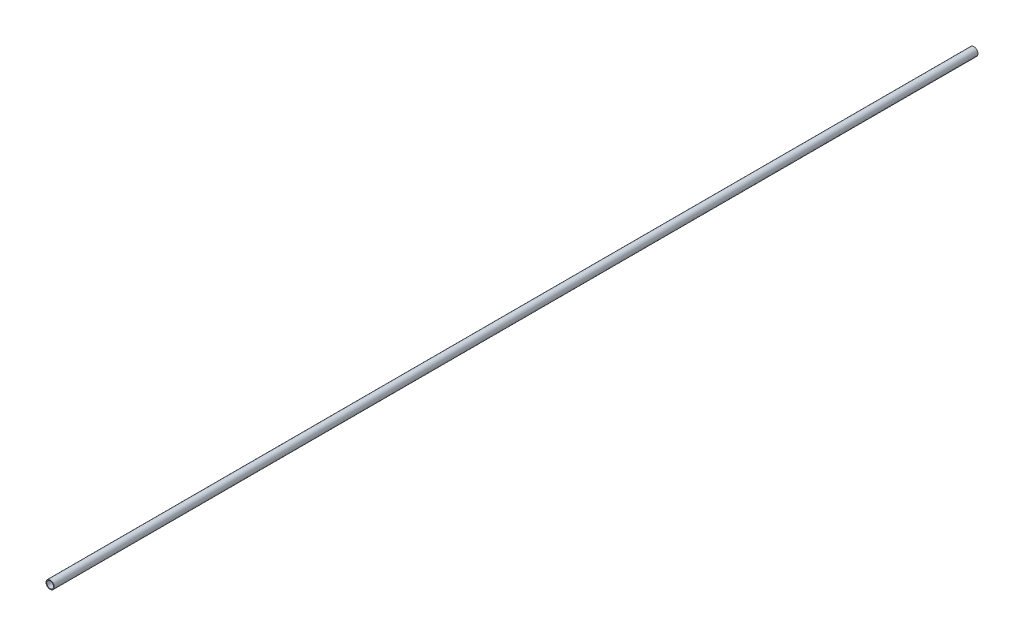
ISO-10303-21;
HEADER;
FILE_DESCRIPTION(('STEP AP214'),'2;1');
FILE_NAME('part.step','',(''),(''),'','','');
FILE_SCHEMA(('AUTOMOTIVE_DESIGN { 1 0 10303 214 1 1 1 1 }'));
ENDSEC;
DATA;
#1=APPLICATION_CONTEXT('core data for automotive mechanical design processes');
#2=APPLICATION_PROTOCOL_DEFINITION('international standard','automotive_design',2000,#1);
#3=PRODUCT_CONTEXT('',#1,'mechanical');
#4=PRODUCT('Part','Part','',(#3));
#5=PRODUCT_RELATED_PRODUCT_CATEGORY('part','',(#4));
#6=PRODUCT_DEFINITION_FORMATION('','',#4);
#7=PRODUCT_DEFINITION_CONTEXT('part definition',#1,'design');
#8=PRODUCT_DEFINITION('design','',#6,#7);
#9=PRODUCT_DEFINITION_SHAPE('','',#8);
#10=(LENGTH_UNIT() NAMED_UNIT(*) SI_UNIT(.MILLI.,.METRE.));
#11=(NAMED_UNIT(*) PLANE_ANGLE_UNIT() SI_UNIT($,.RADIAN.));
#12=(NAMED_UNIT(*) SI_UNIT($,.STERADIAN.) SOLID_ANGLE_UNIT());
#13=UNCERTAINTY_MEASURE_WITH_UNIT(LENGTH_MEASURE(1.E-05),#10,'distance_accuracy_value','');
#14=(GEOMETRIC_REPRESENTATION_CONTEXT(3) GLOBAL_UNCERTAINTY_ASSIGNED_CONTEXT((#13)) GLOBAL_UNIT_ASSIGNED_CONTEXT((#10,
#11,#12)) REPRESENTATION_CONTEXT('',''));
#15=CARTESIAN_POINT('',(0.,0.,0.));
#16=DIRECTION('',(0.,0.,1.));
#17=DIRECTION('',(1.,0.,0.));
#18=AXIS2_PLACEMENT_3D('',#15,#16,#17);
#19=CARTESIAN_POINT('',(0.,0.,1350.));
#20=DIRECTION('',(0.,0.,1.));
#21=DIRECTION('',(1.,0.,0.));
#22=AXIS2_PLACEMENT_3D('',#19,#20,#21);
#23=PLANE('',#22);
#24=CARTESIAN_POINT('',(0.,0.,1350.));
#25=DIRECTION('',(0.,0.,1.));
#26=DIRECTION('',(1.,0.,0.));
#27=AXIS2_PLACEMENT_3D('',#24,#25,#26);
#28=CIRCLE('',#27,6.);
#29=CARTESIAN_POINT('',(6.,0.,1350.));
#30=VERTEX_POINT('',#29);
#31=EDGE_CURVE('E10',#30,#30,#28,.T.);
#32=ORIENTED_EDGE('',*,*,#31,.T.);
#33=EDGE_LOOP('',(#32));
#34=FACE_BOUND('',#33,.T.);
#35=CARTESIAN_POINT('',(0.,0.,1350.));
#36=DIRECTION('',(0.,0.,1.));
#37=DIRECTION('',(1.,0.,0.));
#38=AXIS2_PLACEMENT_3D('',#35,#36,#37);
#39=CIRCLE('',#38,5.);
#40=CARTESIAN_POINT('',(5.,0.,1350.));
#41=VERTEX_POINT('',#40);
#42=EDGE_CURVE('E53',#41,#41,#39,.T.);
#43=ORIENTED_EDGE('',*,*,#42,.F.);
#44=EDGE_LOOP('',(#43));
#45=FACE_BOUND('',#44,.T.);
#46=ADVANCED_FACE('F40',(#34,#45),#23,.T.);
#47=CARTESIAN_POINT('',(0.,0.,0.));
#48=DIRECTION('',(0.,0.,1.));
#49=DIRECTION('',(1.,0.,0.));
#50=AXIS2_PLACEMENT_3D('',#47,#48,#49);
#51=PLANE('',#50);
#52=CARTESIAN_POINT('',(0.,0.,0.));
#53=DIRECTION('',(0.,0.,1.));
#54=DIRECTION('',(1.,0.,0.));
#55=AXIS2_PLACEMENT_3D('',#52,#53,#54);
#56=CIRCLE('',#55,6.);
#57=CARTESIAN_POINT('',(6.,0.,0.));
#58=VERTEX_POINT('',#57);
#59=EDGE_CURVE('E44',#58,#58,#56,.T.);
#60=ORIENTED_EDGE('',*,*,#59,.F.);
#61=EDGE_LOOP('',(#60));
#62=FACE_BOUND('',#61,.T.);
#63=CARTESIAN_POINT('',(0.,0.,0.));
#64=DIRECTION('',(0.,0.,1.));
#65=DIRECTION('',(1.,0.,0.));
#66=AXIS2_PLACEMENT_3D('',#63,#64,#65);
#67=CIRCLE('',#66,5.);
#68=CARTESIAN_POINT('',(5.,0.,0.));
#69=VERTEX_POINT('',#68);
#70=EDGE_CURVE('E55',#69,#69,#67,.T.);
#71=ORIENTED_EDGE('',*,*,#70,.T.);
#72=EDGE_LOOP('',(#71));
#73=FACE_BOUND('',#72,.T.);
#74=ADVANCED_FACE('F67',(#62,#73),#51,.F.);
#75=CARTESIAN_POINT('',(0.,0.,1350.));
#76=DIRECTION('',(0.,0.,-1.));
#77=DIRECTION('',(-1.,0.,0.));
#78=AXIS2_PLACEMENT_3D('',#75,#76,#77);
#79=CYLINDRICAL_SURFACE('',#78,6.);
#80=ORIENTED_EDGE('',*,*,#31,.F.);
#81=EDGE_LOOP('',(#80));
#82=FACE_BOUND('',#81,.T.);
#83=ORIENTED_EDGE('',*,*,#59,.T.);
#84=EDGE_LOOP('',(#83));
#85=FACE_BOUND('',#84,.T.);
#86=ADVANCED_FACE('F42',(#82,#85),#79,.T.);
#87=CARTESIAN_POINT('',(0.,0.,1350.));
#88=DIRECTION('',(0.,0.,-1.));
#89=DIRECTION('',(-1.,0.,0.));
#90=AXIS2_PLACEMENT_3D('',#87,#88,#89);
#91=CYLINDRICAL_SURFACE('',#90,5.);
#92=ORIENTED_EDGE('',*,*,#42,.T.);
#93=EDGE_LOOP('',(#92));
#94=FACE_BOUND('',#93,.T.);
#95=ORIENTED_EDGE('',*,*,#70,.F.);
#96=EDGE_LOOP('',(#95));
#97=FACE_BOUND('',#96,.T.);
#98=ADVANCED_FACE('F63',(#94,#97),#91,.F.);
#99=CLOSED_SHELL('',(#46,#74,#86,#98));
#100=MANIFOLD_SOLID_BREP('B2',#99);
#101=ADVANCED_BREP_SHAPE_REPRESENTATION('',(#18,#100),#14);
#102=SHAPE_DEFINITION_REPRESENTATION(#9,#101);
ENDSEC;
END-ISO-10303-21;
